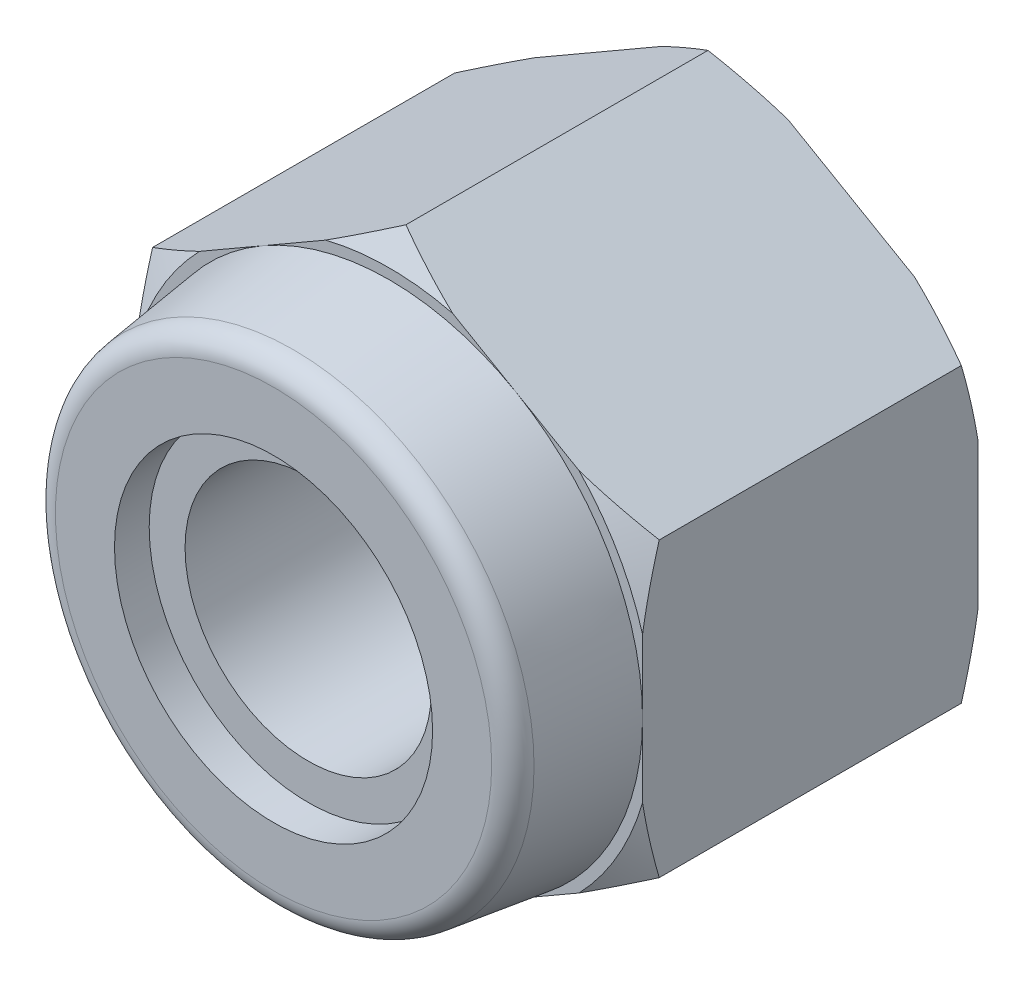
from build123d import *

# Parameters (mm, degrees)
BASENUTSKE_R  = 2.7051
BASENUT_DEPTH = 7.366


with BuildPart() as part:
    # BaseNutSke → BaseNut (new body)
    with BuildSketch(Plane.XY):
        Polygon((5.5626, -3.211568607), (5.5626, 3.211568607), (0, 6.423137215), (-5.5626, 3.211568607), (-5.5626, -3.211568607), (0, -6.423137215), align=None)
        Circle(BASENUTSKE_R, mode=Mode.SUBTRACT)
    extrude(amount=-BASENUT_DEPTH)

    # TorqEleSke → TorqueElement (revolve)
    with BuildSketch(Plane(origin=(0, 0, 0), x_dir=(0, 0, -1), z_dir=(0, 1, 0)), mode=Mode.PRIVATE) as torqueelement_sk:
        with BuildLine():
            Line((-1.778, 3.4925), (-1.778, 2.7051))
            Line((-1.778, 2.7051), (0, 2.7051))
            Line((0, 2.7051), (0, 5.5626))
            Line((0, 5.5626), (-2.105263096, 5.285436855))
            ThreePointArc((-2.105263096, 5.285436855), (-2.415919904, 5.119387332), (-2.54, 4.789714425))
            Line((-2.54, 4.789714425), (-2.54, 3.4925))
            Line((-2.54, 3.4925), (-1.778, 3.4925))
        make_face()
    revolve(torqueelement_sk.sketch.rotate(Axis((0, 0, 9.480888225), (0, 0, -1)), 180), axis=Axis((0, 0, 9.480888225), (0, 0, -1)))

    # Sketch3 → DoubleChamfer (revolve, cut)
    with BuildSketch(Plane(origin=(0, 0, 0), x_dir=(0, 0, -1), z_dir=(1, 0, 0))):
        Polygon((7.366, 5.788137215), (6.999382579, 6.423137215), (7.366, 6.423137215), align=None)
        Polygon((0, 6.423137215), (0, 5.788137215), (0.366617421, 6.423137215), align=None)
    revolve(axis=Axis((0, 0, 0), (0, 0, -1)), mode=Mode.SUBTRACT)

    # ThdSchSke → ThreadSchematic (revolve, cut)
    with BuildSketch(Plane(origin=(0, 0, 0), x_dir=(1, 0, 0), z_dir=(0, 1, 0)), mode=Mode.PRIVATE) as threadschematic_sk:
        Polygon((-3.175, 7.366), (-2.7051, 7.637296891), (-2.7051, 7.094703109), align=None)
    revolve(threadschematic_sk.sketch.rotate(Axis((0, 0, 1.481463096), (0, 0, 1)), 180), axis=Axis((0, 0, 1.481463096), (0, 0, 1)), mode=Mode.SUBTRACT)


solid = part.part
